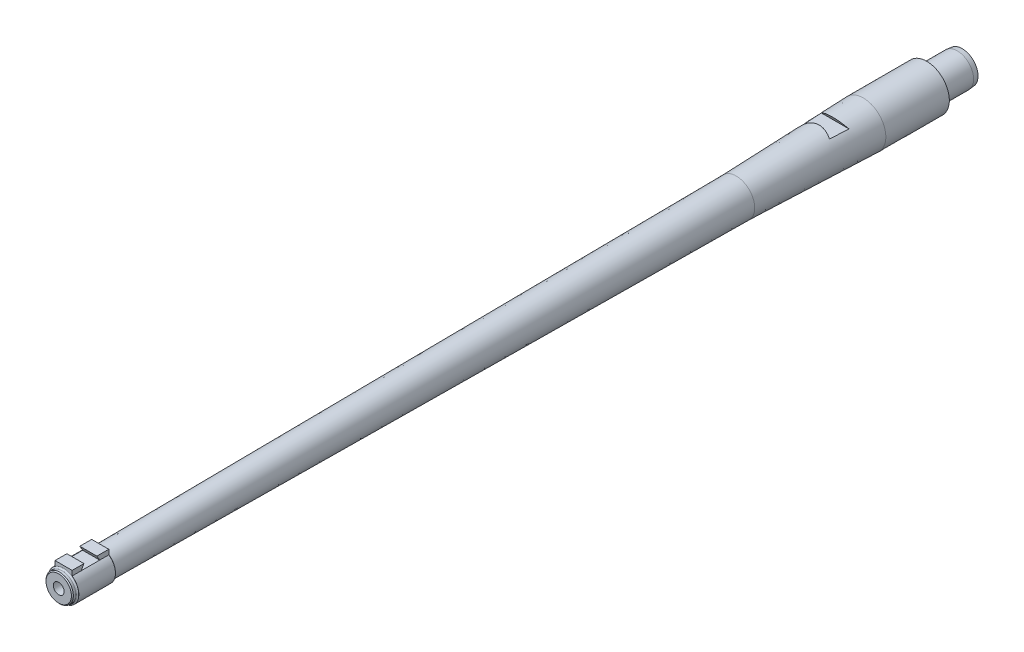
from build123d import *

# Parameters (mm, degrees)
CUT_EXTRUDE1_DEPTH      = 419.794655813
CUT_EXTRUDE1_DEPTH_BACK = 419.794655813
BOSS_EXTRUDE1_DEPTH     = 19.05
CUT_EXTRUDE2_DEPTH      = 419.942904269
CUT_EXTRUDE2_DEPTH_BACK = 419.942904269
CUT_EXTRUDE3_DEPTH      = 419.794655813
CUT_EXTRUDE3_DEPTH_BACK = 419.794655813
CHAMFER1_SIZE           = 2.54
CHAMFER1_SIZE2          = 0.254
CUT_EXTRUDE4_DEPTH      = 1.5875
CUT_EXTRUDE4_DEPTH_BACK = 1.5875


with BuildPart() as part:
    # Sketch4 → Revolve1 (revolve)
    with BuildSketch(Plane(origin=(0, 0, 0), x_dir=(0, 0, -1), z_dir=(1, 0, 0)), mode=Mode.PRIVATE) as revolve1_sk:
        with BuildLine():
            Line((-396.107296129, 7.117746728), (-66.04, 9.5885))
            Line((-66.04, 9.5885), (0, 11.7475))
            Line((0, 11.7475), (33.02, 11.7475))
            Line((33.02, 11.7475), (33.02, 8.509))
            Line((33.02, 8.509), (51.435, 8.509))
            Line((51.435, 8.509), (51.435, 2.81305))
            Line((51.435, 2.81305), (-418.465, 2.81305))
            Line((-418.465, 2.81305), (-418.465, 6.604))
            Line((-418.465, 6.604), (-417.957, 7.112))
            Line((-417.957, 7.112), (-416.687, 7.112))
            ThreePointArc((-416.687, 7.112), (-416.148184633, 7.335184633), (-415.925, 7.874))
            Line((-415.925, 7.874), (-415.925, 7.9375))
            Line((-415.925, 7.9375), (-396.875, 7.9375))
            Line((-396.875, 7.9375), (-396.875, 7.879725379))
            ThreePointArc((-396.875, 7.879725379), (-396.649794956, 7.338897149), (-396.107296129, 7.117746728))
        make_face()
    revolve(revolve1_sk.sketch.rotate(Axis((0, 0, -66.962588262), (0, 0, 1)), 90), axis=Axis((0, 0, -66.962588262), (0, 0, 1)))

    # Sketch6 → Cut-Extrude1 (cut, two sides: drawn at the far end of the back side and taken through both)
    with BuildSketch(Plane(origin=(0, 0, 0), x_dir=(0, 0, -1), z_dir=(1, 0, 0)).offset(-CUT_EXTRUDE1_DEPTH_BACK)):
        Polygon((-1.481549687, -23.135049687), (14.351, -7.3025), (1.651, -7.3025), (-14.181549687, -23.135049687), align=None)
    extrude(amount=CUT_EXTRUDE1_DEPTH + CUT_EXTRUDE1_DEPTH_BACK, mode=Mode.SUBTRACT)

    # Sketch7 → Boss-Extrude1 (add)
    with BuildSketch(Plane.XY.offset(396.875)):
        with BuildLine():
            Line((-4.445, 9.116160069), (4.445, 9.116160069))
            Line((4.445, 9.116160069), (4.445, 6.576160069))
            ThreePointArc((4.445, 6.576160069), (0, 7.9375), (-4.445, 6.576160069))
            Line((-4.445, 6.576160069), (-4.445, 9.116160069))
        make_face()
    extrude(amount=BOSS_EXTRUDE1_DEPTH)

    # Sketch10 → Cut-Extrude2 (cut, two sides: drawn at the far end of the back side and taken through both)
    with BuildSketch(Plane(origin=(4.445, 0, 0), x_dir=(0, 0, -1), z_dir=(1, 0, 0)).offset(-CUT_EXTRUDE2_DEPTH_BACK)):
        Polygon((-411.226, 6.576160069), (-409.759530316, 9.116160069), (-403.040469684, 9.116160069), (-401.574, 6.576160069), align=None)
    extrude(amount=CUT_EXTRUDE2_DEPTH + CUT_EXTRUDE2_DEPTH_BACK, mode=Mode.SUBTRACT)

    # Sketch12 → Cut-Extrude3 (cut, two sides: drawn at the far end of the back side and taken through both)
    with BuildSketch(Plane(origin=(0, 0, 0), x_dir=(0, 0, -1), z_dir=(1, 0, 0)).offset(-CUT_EXTRUDE3_DEPTH_BACK)):
        Polygon((-14.605, 8.682086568), (-24.257, 8.682086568), (-21.985168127, 12.617014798), (-16.876831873, 12.617014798), align=None)
    extrude(amount=CUT_EXTRUDE3_DEPTH + CUT_EXTRUDE3_DEPTH_BACK, mode=Mode.SUBTRACT)

    # Chamfer1
    chamfer1_edges = [part.edges().sort_by_distance(p)[0] for p in [
        (8.509, 0, -51.435),
    ]]
    chamfer1_side = [part.faces().sort_by_distance(p)[0] for p in [
        (8.509, 0, -42.2275),
    ]]
    chamfer(chamfer1_edges, length=CHAMFER1_SIZE, length2=CHAMFER1_SIZE2, reference=chamfer1_side[0])

    # Sketch13 → Cut-Extrude4 (cut, two sides: drawn at the far end of the back side and taken through both)
    with BuildSketch(Plane(origin=(0, 0, 0), x_dir=(0, 0, 1), z_dir=(-0.17364817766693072, 0.984807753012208, 0)).offset(-CUT_EXTRUDE4_DEPTH_BACK)):
        Polygon((-48.895, -8.509), (-45.6311, -8.509), (-51.435, -2.81305), (-51.435, -8.255), (-51.435, -8.509), align=None)
    extrude(amount=CUT_EXTRUDE4_DEPTH + CUT_EXTRUDE4_DEPTH_BACK, mode=Mode.SUBTRACT)


solid = part.part
